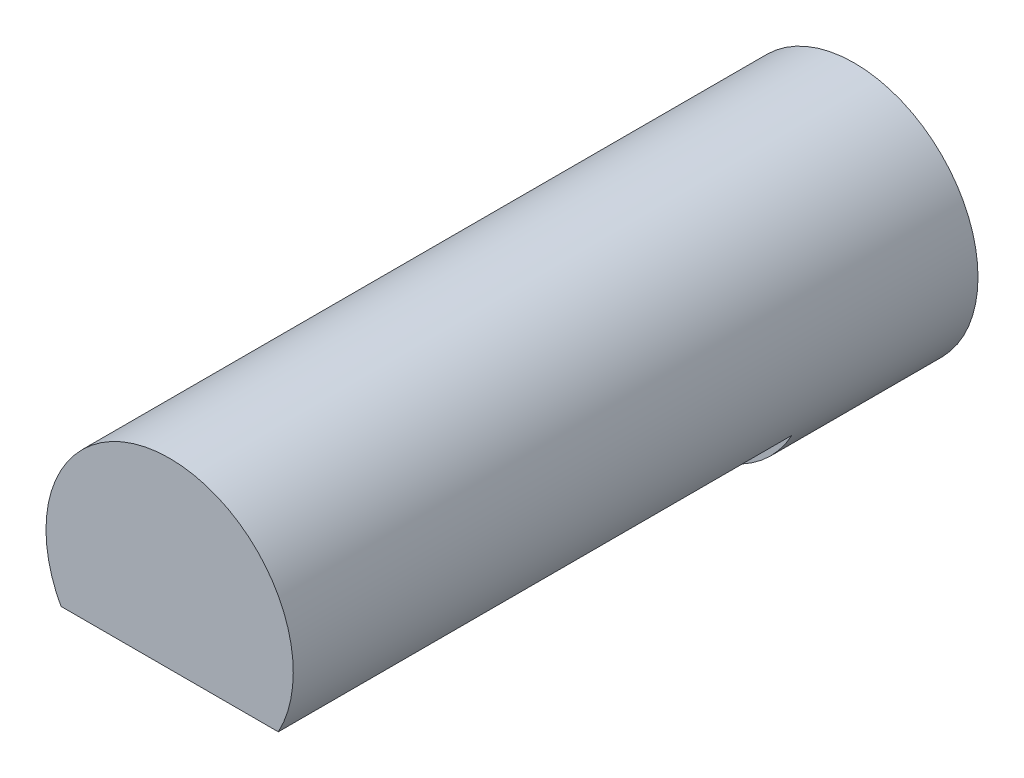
ISO-10303-21;
HEADER;
FILE_DESCRIPTION(('STEP AP214'),'2;1');
FILE_NAME('part.step','',(''),(''),'','','');
FILE_SCHEMA(('AUTOMOTIVE_DESIGN { 1 0 10303 214 1 1 1 1 }'));
ENDSEC;
DATA;
#1=APPLICATION_CONTEXT('core data for automotive mechanical design processes');
#2=APPLICATION_PROTOCOL_DEFINITION('international standard','automotive_design',2000,#1);
#3=PRODUCT_CONTEXT('',#1,'mechanical');
#4=PRODUCT('Part','Part','',(#3));
#5=PRODUCT_RELATED_PRODUCT_CATEGORY('part','',(#4));
#6=PRODUCT_DEFINITION_FORMATION('','',#4);
#7=PRODUCT_DEFINITION_CONTEXT('part definition',#1,'design');
#8=PRODUCT_DEFINITION('design','',#6,#7);
#9=PRODUCT_DEFINITION_SHAPE('','',#8);
#10=(LENGTH_UNIT() NAMED_UNIT(*) SI_UNIT(.MILLI.,.METRE.));
#11=(NAMED_UNIT(*) PLANE_ANGLE_UNIT() SI_UNIT($,.RADIAN.));
#12=(NAMED_UNIT(*) SI_UNIT($,.STERADIAN.) SOLID_ANGLE_UNIT());
#13=UNCERTAINTY_MEASURE_WITH_UNIT(LENGTH_MEASURE(1.E-05),#10,'distance_accuracy_value','');
#14=(GEOMETRIC_REPRESENTATION_CONTEXT(3) GLOBAL_UNCERTAINTY_ASSIGNED_CONTEXT((#13)) GLOBAL_UNIT_ASSIGNED_CONTEXT((#10,
#11,#12)) REPRESENTATION_CONTEXT('',''));
#15=CARTESIAN_POINT('',(0.,0.,0.));
#16=DIRECTION('',(0.,0.,1.));
#17=DIRECTION('',(1.,0.,0.));
#18=AXIS2_PLACEMENT_3D('',#15,#16,#17);
#19=CARTESIAN_POINT('',(0.,0.,18.));
#20=DIRECTION('',(0.,0.,-1.));
#21=DIRECTION('',(-1.,0.,0.));
#22=AXIS2_PLACEMENT_3D('',#19,#20,#21);
#23=CYLINDRICAL_SURFACE('',#22,3.25);
#24=CARTESIAN_POINT('',(0.,0.,0.));
#25=DIRECTION('',(0.,0.,1.));
#26=DIRECTION('',(1.,0.,0.));
#27=AXIS2_PLACEMENT_3D('',#24,#25,#26);
#28=CIRCLE('',#27,3.25);
#29=CARTESIAN_POINT('',(3.25,0.,0.));
#30=VERTEX_POINT('',#29);
#31=EDGE_CURVE('E42',#30,#30,#28,.T.);
#32=ORIENTED_EDGE('',*,*,#31,.T.);
#33=EDGE_LOOP('',(#32));
#34=FACE_BOUND('',#33,.T.);
#35=DIRECTION('',(0.,0.,1.));
#36=VECTOR('',#35,1.);
#37=CARTESIAN_POINT('',(-2.85657137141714,-1.55,4.5));
#38=LINE('',#37,#36);
#39=CARTESIAN_POINT('',(-2.85657137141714,-1.55,4.5));
#40=VERTEX_POINT('',#39);
#41=CARTESIAN_POINT('',(-2.85657137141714,-1.55,18.));
#42=VERTEX_POINT('',#41);
#43=EDGE_CURVE('E62',#40,#42,#38,.T.);
#44=ORIENTED_EDGE('',*,*,#43,.T.);
#45=CARTESIAN_POINT('',(0.,0.,18.));
#46=DIRECTION('',(0.,0.,1.));
#47=DIRECTION('',(1.,0.,0.));
#48=AXIS2_PLACEMENT_3D('',#45,#46,#47);
#49=CIRCLE('',#48,3.25);
#50=CARTESIAN_POINT('',(2.85657137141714,-1.55,18.));
#51=VERTEX_POINT('',#50);
#52=EDGE_CURVE('E11',#51,#42,#49,.T.);
#53=ORIENTED_EDGE('',*,*,#52,.F.);
#54=DIRECTION('',(0.,0.,1.));
#55=VECTOR('',#54,1.);
#56=CARTESIAN_POINT('',(2.85657137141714,-1.55,4.5));
#57=LINE('',#56,#55);
#58=CARTESIAN_POINT('',(2.85657137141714,-1.55,4.5));
#59=VERTEX_POINT('',#58);
#60=EDGE_CURVE('E49',#59,#51,#57,.T.);
#61=ORIENTED_EDGE('',*,*,#60,.F.);
#62=CARTESIAN_POINT('',(0.,0.,4.5));
#63=DIRECTION('',(0.,0.,1.));
#64=DIRECTION('',(1.,0.,0.));
#65=AXIS2_PLACEMENT_3D('',#62,#63,#64);
#66=CIRCLE('',#65,3.25);
#67=EDGE_CURVE('E68',#40,#59,#66,.T.);
#68=ORIENTED_EDGE('',*,*,#67,.F.);
#69=EDGE_LOOP('',(#44,#53,#61,#68));
#70=FACE_BOUND('',#69,.T.);
#71=ADVANCED_FACE('F35',(#34,#70),#23,.T.);
#72=CARTESIAN_POINT('',(0.,0.,18.));
#73=DIRECTION('',(0.,0.,1.));
#74=DIRECTION('',(1.,0.,0.));
#75=AXIS2_PLACEMENT_3D('',#72,#73,#74);
#76=PLANE('',#75);
#77=ORIENTED_EDGE('',*,*,#52,.T.);
#78=DIRECTION('',(1.,0.,0.));
#79=VECTOR('',#78,1.);
#80=CARTESIAN_POINT('',(0.,-1.55,18.));
#81=LINE('',#80,#79);
#82=EDGE_CURVE('E59',#42,#51,#81,.T.);
#83=ORIENTED_EDGE('',*,*,#82,.T.);
#84=EDGE_LOOP('',(#77,#83));
#85=FACE_BOUND('',#84,.T.);
#86=ADVANCED_FACE('F70',(#85),#76,.T.);
#87=CARTESIAN_POINT('',(0.,0.,0.));
#88=DIRECTION('',(0.,0.,1.));
#89=DIRECTION('',(1.,0.,0.));
#90=AXIS2_PLACEMENT_3D('',#87,#88,#89);
#91=PLANE('',#90);
#92=ORIENTED_EDGE('',*,*,#31,.F.);
#93=EDGE_LOOP('',(#92));
#94=FACE_BOUND('',#93,.T.);
#95=ADVANCED_FACE('F72',(#94),#91,.F.);
#96=CARTESIAN_POINT('',(0.,-1.55,4.5));
#97=DIRECTION('',(0.,-1.,0.));
#98=DIRECTION('',(0.,0.,-1.));
#99=AXIS2_PLACEMENT_3D('',#96,#97,#98);
#100=PLANE('',#99);
#101=ORIENTED_EDGE('',*,*,#82,.F.);
#102=ORIENTED_EDGE('',*,*,#43,.F.);
#103=DIRECTION('',(1.,0.,0.));
#104=VECTOR('',#103,1.);
#105=CARTESIAN_POINT('',(0.,-1.55,4.5));
#106=LINE('',#105,#104);
#107=EDGE_CURVE('E54',#40,#59,#106,.T.);
#108=ORIENTED_EDGE('',*,*,#107,.T.);
#109=ORIENTED_EDGE('',*,*,#60,.T.);
#110=EDGE_LOOP('',(#101,#102,#108,#109));
#111=FACE_BOUND('',#110,.T.);
#112=ADVANCED_FACE('F61',(#111),#100,.T.);
#113=CARTESIAN_POINT('',(0.,-7.29142135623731,4.5));
#114=DIRECTION('',(0.,0.,1.));
#115=DIRECTION('',(1.,0.,0.));
#116=AXIS2_PLACEMENT_3D('',#113,#114,#115);
#117=PLANE('',#116);
#118=ORIENTED_EDGE('',*,*,#107,.F.);
#119=ORIENTED_EDGE('',*,*,#67,.T.);
#120=EDGE_LOOP('',(#118,#119));
#121=FACE_BOUND('',#120,.T.);
#122=ADVANCED_FACE('F83',(#121),#117,.T.);
#123=CLOSED_SHELL('',(#71,#86,#95,#112,#122));
#124=MANIFOLD_SOLID_BREP('B2',#123);
#125=ADVANCED_BREP_SHAPE_REPRESENTATION('',(#18,#124),#14);
#126=SHAPE_DEFINITION_REPRESENTATION(#9,#125);
ENDSEC;
END-ISO-10303-21;
